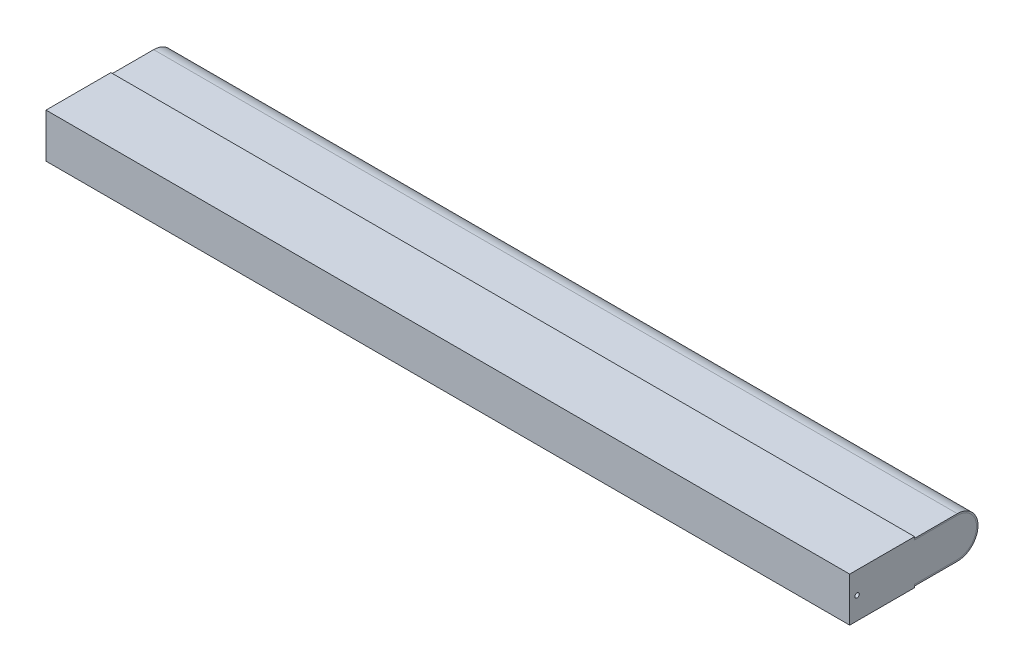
ISO-10303-21;
HEADER;
FILE_DESCRIPTION(('STEP AP214'),'2;1');
FILE_NAME('part.step','',(''),(''),'','','');
FILE_SCHEMA(('AUTOMOTIVE_DESIGN { 1 0 10303 214 1 1 1 1 }'));
ENDSEC;
DATA;
#1=APPLICATION_CONTEXT('core data for automotive mechanical design processes');
#2=APPLICATION_PROTOCOL_DEFINITION('international standard','automotive_design',2000,#1);
#3=PRODUCT_CONTEXT('',#1,'mechanical');
#4=PRODUCT('Part','Part','',(#3));
#5=PRODUCT_RELATED_PRODUCT_CATEGORY('part','',(#4));
#6=PRODUCT_DEFINITION_FORMATION('','',#4);
#7=PRODUCT_DEFINITION_CONTEXT('part definition',#1,'design');
#8=PRODUCT_DEFINITION('design','',#6,#7);
#9=PRODUCT_DEFINITION_SHAPE('','',#8);
#10=(LENGTH_UNIT() NAMED_UNIT(*) SI_UNIT(.MILLI.,.METRE.));
#11=(NAMED_UNIT(*) PLANE_ANGLE_UNIT() SI_UNIT($,.RADIAN.));
#12=(NAMED_UNIT(*) SI_UNIT($,.STERADIAN.) SOLID_ANGLE_UNIT());
#13=UNCERTAINTY_MEASURE_WITH_UNIT(LENGTH_MEASURE(1.E-05),#10,'distance_accuracy_value','');
#14=(GEOMETRIC_REPRESENTATION_CONTEXT(3) GLOBAL_UNCERTAINTY_ASSIGNED_CONTEXT((#13)) GLOBAL_UNIT_ASSIGNED_CONTEXT((#10,
#11,#12)) REPRESENTATION_CONTEXT('',''));
#15=CARTESIAN_POINT('',(0.,0.,0.));
#16=DIRECTION('',(0.,0.,1.));
#17=DIRECTION('',(1.,0.,0.));
#18=AXIS2_PLACEMENT_3D('',#15,#16,#17);
#19=CARTESIAN_POINT('',(545.,1.,-44.));
#20=DIRECTION('',(0.,-1.,0.));
#21=DIRECTION('',(0.,0.,-1.));
#22=AXIS2_PLACEMENT_3D('',#19,#20,#21);
#23=PLANE('',#22);
#24=DIRECTION('',(0.,0.,1.));
#25=VECTOR('',#24,1.);
#26=CARTESIAN_POINT('',(0.,1.,-44.));
#27=LINE('',#26,#25);
#28=CARTESIAN_POINT('',(0.,0.999999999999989,-73.));
#29=VERTEX_POINT('',#28);
#30=CARTESIAN_POINT('',(0.,1.,-44.));
#31=VERTEX_POINT('',#30);
#32=EDGE_CURVE('E146',#29,#31,#27,.T.);
#33=ORIENTED_EDGE('',*,*,#32,.F.);
#34=DIRECTION('',(-1.,0.,0.));
#35=VECTOR('',#34,1.);
#36=CARTESIAN_POINT('',(545.,0.999999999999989,-73.));
#37=LINE('',#36,#35);
#38=CARTESIAN_POINT('',(545.,0.999999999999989,-73.));
#39=VERTEX_POINT('',#38);
#40=EDGE_CURVE('E12',#39,#29,#37,.T.);
#41=ORIENTED_EDGE('',*,*,#40,.F.);
#42=DIRECTION('',(0.,0.,1.));
#43=VECTOR('',#42,1.);
#44=CARTESIAN_POINT('',(545.,1.,-44.));
#45=LINE('',#44,#43);
#46=CARTESIAN_POINT('',(545.,1.,-44.));
#47=VERTEX_POINT('',#46);
#48=EDGE_CURVE('E166',#39,#47,#45,.T.);
#49=ORIENTED_EDGE('',*,*,#48,.T.);
#50=DIRECTION('',(-1.,0.,0.));
#51=VECTOR('',#50,1.);
#52=CARTESIAN_POINT('',(545.,1.,-44.));
#53=LINE('',#52,#51);
#54=EDGE_CURVE('E52',#47,#31,#53,.T.);
#55=ORIENTED_EDGE('',*,*,#54,.T.);
#56=EDGE_LOOP('',(#33,#41,#49,#55));
#57=FACE_BOUND('',#56,.T.);
#58=ADVANCED_FACE('F49',(#57),#23,.T.);
#59=CARTESIAN_POINT('',(545.,15.,-73.));
#60=DIRECTION('',(-1.,0.,0.));
#61=DIRECTION('',(0.,0.,1.));
#62=AXIS2_PLACEMENT_3D('',#59,#60,#61);
#63=CYLINDRICAL_SURFACE('',#62,14.);
#64=CARTESIAN_POINT('',(0.,15.,-73.));
#65=DIRECTION('',(-1.,0.,0.));
#66=DIRECTION('',(0.,0.,1.));
#67=AXIS2_PLACEMENT_3D('',#64,#65,#66);
#68=CIRCLE('',#67,14.);
#69=CARTESIAN_POINT('',(0.,29.,-73.));
#70=VERTEX_POINT('',#69);
#71=EDGE_CURVE('E164',#70,#29,#68,.T.);
#72=ORIENTED_EDGE('',*,*,#71,.F.);
#73=DIRECTION('',(-1.,0.,0.));
#74=VECTOR('',#73,1.);
#75=CARTESIAN_POINT('',(545.,29.,-73.));
#76=LINE('',#75,#74);
#77=CARTESIAN_POINT('',(545.,29.,-73.));
#78=VERTEX_POINT('',#77);
#79=EDGE_CURVE('E58',#78,#70,#76,.T.);
#80=ORIENTED_EDGE('',*,*,#79,.F.);
#81=CARTESIAN_POINT('',(545.,15.,-73.));
#82=DIRECTION('',(-1.,0.,0.));
#83=DIRECTION('',(0.,0.,1.));
#84=AXIS2_PLACEMENT_3D('',#81,#82,#83);
#85=CIRCLE('',#84,14.);
#86=EDGE_CURVE('E136',#78,#39,#85,.T.);
#87=ORIENTED_EDGE('',*,*,#86,.T.);
#88=ORIENTED_EDGE('',*,*,#40,.T.);
#89=EDGE_LOOP('',(#72,#80,#87,#88));
#90=FACE_BOUND('',#89,.T.);
#91=ADVANCED_FACE('F178',(#90),#63,.T.);
#92=CARTESIAN_POINT('',(545.,29.,-73.));
#93=DIRECTION('',(0.,1.,0.));
#94=DIRECTION('',(0.,0.,1.));
#95=AXIS2_PLACEMENT_3D('',#92,#93,#94);
#96=PLANE('',#95);
#97=DIRECTION('',(0.,0.,-1.));
#98=VECTOR('',#97,1.);
#99=CARTESIAN_POINT('',(0.,29.,-73.));
#100=LINE('',#99,#98);
#101=CARTESIAN_POINT('',(0.,29.,-44.));
#102=VERTEX_POINT('',#101);
#103=EDGE_CURVE('E123',#102,#70,#100,.T.);
#104=ORIENTED_EDGE('',*,*,#103,.F.);
#105=DIRECTION('',(-1.,0.,0.));
#106=VECTOR('',#105,1.);
#107=CARTESIAN_POINT('',(545.,29.,-44.));
#108=LINE('',#107,#106);
#109=CARTESIAN_POINT('',(545.,29.,-44.));
#110=VERTEX_POINT('',#109);
#111=EDGE_CURVE('E118',#110,#102,#108,.T.);
#112=ORIENTED_EDGE('',*,*,#111,.F.);
#113=DIRECTION('',(0.,0.,-1.));
#114=VECTOR('',#113,1.);
#115=CARTESIAN_POINT('',(545.,29.,-73.));
#116=LINE('',#115,#114);
#117=EDGE_CURVE('E121',#110,#78,#116,.T.);
#118=ORIENTED_EDGE('',*,*,#117,.T.);
#119=ORIENTED_EDGE('',*,*,#79,.T.);
#120=EDGE_LOOP('',(#104,#112,#118,#119));
#121=FACE_BOUND('',#120,.T.);
#122=ADVANCED_FACE('F120',(#121),#96,.T.);
#123=CARTESIAN_POINT('',(545.,29.,-44.));
#124=DIRECTION('',(0.,0.,1.));
#125=DIRECTION('',(1.,0.,0.));
#126=AXIS2_PLACEMENT_3D('',#123,#124,#125);
#127=PLANE('',#126);
#128=DIRECTION('',(0.,1.,0.));
#129=VECTOR('',#128,1.);
#130=CARTESIAN_POINT('',(0.,29.,-44.));
#131=LINE('',#130,#129);
#132=CARTESIAN_POINT('',(0.,28.,-44.));
#133=VERTEX_POINT('',#132);
#134=EDGE_CURVE('E161',#133,#102,#131,.T.);
#135=ORIENTED_EDGE('',*,*,#134,.F.);
#136=DIRECTION('',(-1.,0.,0.));
#137=VECTOR('',#136,1.);
#138=CARTESIAN_POINT('',(545.,28.,-44.));
#139=LINE('',#138,#137);
#140=CARTESIAN_POINT('',(545.,28.,-44.));
#141=VERTEX_POINT('',#140);
#142=EDGE_CURVE('E128',#141,#133,#139,.T.);
#143=ORIENTED_EDGE('',*,*,#142,.F.);
#144=DIRECTION('',(0.,1.,0.));
#145=VECTOR('',#144,1.);
#146=CARTESIAN_POINT('',(545.,29.,-44.));
#147=LINE('',#146,#145);
#148=EDGE_CURVE('E134',#141,#110,#147,.T.);
#149=ORIENTED_EDGE('',*,*,#148,.T.);
#150=ORIENTED_EDGE('',*,*,#111,.T.);
#151=EDGE_LOOP('',(#135,#143,#149,#150));
#152=FACE_BOUND('',#151,.T.);
#153=ADVANCED_FACE('F138',(#152),#127,.T.);
#154=CARTESIAN_POINT('',(545.,28.,-73.));
#155=DIRECTION('',(0.,-1.,0.));
#156=DIRECTION('',(0.,0.,-1.));
#157=AXIS2_PLACEMENT_3D('',#154,#155,#156);
#158=PLANE('',#157);
#159=DIRECTION('',(0.,0.,1.));
#160=VECTOR('',#159,1.);
#161=CARTESIAN_POINT('',(0.,28.,-73.));
#162=LINE('',#161,#160);
#163=CARTESIAN_POINT('',(0.,28.,-73.));
#164=VERTEX_POINT('',#163);
#165=EDGE_CURVE('E158',#164,#133,#162,.T.);
#166=ORIENTED_EDGE('',*,*,#165,.F.);
#167=DIRECTION('',(-1.,0.,0.));
#168=VECTOR('',#167,1.);
#169=CARTESIAN_POINT('',(545.,28.,-73.));
#170=LINE('',#169,#168);
#171=CARTESIAN_POINT('',(545.,28.,-73.));
#172=VERTEX_POINT('',#171);
#173=EDGE_CURVE('E170',#172,#164,#170,.T.);
#174=ORIENTED_EDGE('',*,*,#173,.F.);
#175=DIRECTION('',(0.,0.,1.));
#176=VECTOR('',#175,1.);
#177=CARTESIAN_POINT('',(545.,28.,-73.));
#178=LINE('',#177,#176);
#179=EDGE_CURVE('E139',#172,#141,#178,.T.);
#180=ORIENTED_EDGE('',*,*,#179,.T.);
#181=ORIENTED_EDGE('',*,*,#142,.T.);
#182=EDGE_LOOP('',(#166,#174,#180,#181));
#183=FACE_BOUND('',#182,.T.);
#184=ADVANCED_FACE('F191',(#183),#158,.T.);
#185=CARTESIAN_POINT('',(545.,15.,-73.));
#186=DIRECTION('',(-1.,0.,0.));
#187=DIRECTION('',(0.,0.,1.));
#188=AXIS2_PLACEMENT_3D('',#185,#186,#187);
#189=CYLINDRICAL_SURFACE('',#188,13.);
#190=CARTESIAN_POINT('',(0.,15.,-73.));
#191=DIRECTION('',(1.,0.,0.));
#192=DIRECTION('',(0.,0.,1.));
#193=AXIS2_PLACEMENT_3D('',#190,#191,#192);
#194=CIRCLE('',#193,13.);
#195=CARTESIAN_POINT('',(0.,1.99999999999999,-73.));
#196=VERTEX_POINT('',#195);
#197=EDGE_CURVE('E155',#196,#164,#194,.T.);
#198=ORIENTED_EDGE('',*,*,#197,.F.);
#199=DIRECTION('',(-1.,0.,0.));
#200=VECTOR('',#199,1.);
#201=CARTESIAN_POINT('',(545.,1.99999999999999,-73.));
#202=LINE('',#201,#200);
#203=CARTESIAN_POINT('',(545.,1.99999999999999,-73.));
#204=VERTEX_POINT('',#203);
#205=EDGE_CURVE('E172',#204,#196,#202,.T.);
#206=ORIENTED_EDGE('',*,*,#205,.F.);
#207=CARTESIAN_POINT('',(545.,15.,-73.));
#208=DIRECTION('',(1.,0.,0.));
#209=DIRECTION('',(0.,0.,1.));
#210=AXIS2_PLACEMENT_3D('',#207,#208,#209);
#211=CIRCLE('',#210,13.);
#212=EDGE_CURVE('E141',#204,#172,#211,.T.);
#213=ORIENTED_EDGE('',*,*,#212,.T.);
#214=ORIENTED_EDGE('',*,*,#173,.T.);
#215=EDGE_LOOP('',(#198,#206,#213,#214));
#216=FACE_BOUND('',#215,.T.);
#217=ADVANCED_FACE('F194',(#216),#189,.F.);
#218=CARTESIAN_POINT('',(545.,2.,-44.));
#219=DIRECTION('',(0.,1.,0.));
#220=DIRECTION('',(0.,0.,1.));
#221=AXIS2_PLACEMENT_3D('',#218,#219,#220);
#222=PLANE('',#221);
#223=DIRECTION('',(0.,0.,-1.));
#224=VECTOR('',#223,1.);
#225=CARTESIAN_POINT('',(0.,2.,-44.));
#226=LINE('',#225,#224);
#227=CARTESIAN_POINT('',(0.,2.,-44.));
#228=VERTEX_POINT('',#227);
#229=EDGE_CURVE('E152',#228,#196,#226,.T.);
#230=ORIENTED_EDGE('',*,*,#229,.F.);
#231=DIRECTION('',(-1.,0.,0.));
#232=VECTOR('',#231,1.);
#233=CARTESIAN_POINT('',(545.,2.,-44.));
#234=LINE('',#233,#232);
#235=CARTESIAN_POINT('',(545.,2.,-44.));
#236=VERTEX_POINT('',#235);
#237=EDGE_CURVE('E173',#236,#228,#234,.T.);
#238=ORIENTED_EDGE('',*,*,#237,.F.);
#239=DIRECTION('',(0.,0.,-1.));
#240=VECTOR('',#239,1.);
#241=CARTESIAN_POINT('',(545.,2.,-44.));
#242=LINE('',#241,#240);
#243=EDGE_CURVE('E269',#236,#204,#242,.T.);
#244=ORIENTED_EDGE('',*,*,#243,.T.);
#245=ORIENTED_EDGE('',*,*,#205,.T.);
#246=EDGE_LOOP('',(#230,#238,#244,#245));
#247=FACE_BOUND('',#246,.T.);
#248=ADVANCED_FACE('F198',(#247),#222,.T.);
#249=CARTESIAN_POINT('',(545.,1.,-44.));
#250=DIRECTION('',(0.,0.,1.));
#251=DIRECTION('',(1.,0.,0.));
#252=AXIS2_PLACEMENT_3D('',#249,#250,#251);
#253=PLANE('',#252);
#254=DIRECTION('',(0.,1.,0.));
#255=VECTOR('',#254,1.);
#256=CARTESIAN_POINT('',(0.,1.,-44.));
#257=LINE('',#256,#255);
#258=EDGE_CURVE('E149',#31,#228,#257,.T.);
#259=ORIENTED_EDGE('',*,*,#258,.F.);
#260=ORIENTED_EDGE('',*,*,#54,.F.);
#261=DIRECTION('',(0.,1.,0.));
#262=VECTOR('',#261,1.);
#263=CARTESIAN_POINT('',(545.,1.,-44.));
#264=LINE('',#263,#262);
#265=EDGE_CURVE('E270',#47,#236,#264,.T.);
#266=ORIENTED_EDGE('',*,*,#265,.T.);
#267=ORIENTED_EDGE('',*,*,#237,.T.);
#268=EDGE_LOOP('',(#259,#260,#266,#267));
#269=FACE_BOUND('',#268,.T.);
#270=ADVANCED_FACE('F175',(#269),#253,.T.);
#271=CARTESIAN_POINT('',(545.,15.,-73.));
#272=DIRECTION('',(-1.,0.,0.));
#273=DIRECTION('',(0.,0.,1.));
#274=AXIS2_PLACEMENT_3D('',#271,#272,#273);
#275=PLANE('',#274);
#276=ORIENTED_EDGE('',*,*,#48,.F.);
#277=ORIENTED_EDGE('',*,*,#86,.F.);
#278=ORIENTED_EDGE('',*,*,#117,.F.);
#279=ORIENTED_EDGE('',*,*,#148,.F.);
#280=ORIENTED_EDGE('',*,*,#179,.F.);
#281=ORIENTED_EDGE('',*,*,#212,.F.);
#282=ORIENTED_EDGE('',*,*,#243,.F.);
#283=ORIENTED_EDGE('',*,*,#265,.F.);
#284=EDGE_LOOP('',(#276,#277,#278,#279,#280,#281,#282,#283));
#285=FACE_BOUND('',#284,.T.);
#286=ADVANCED_FACE('F132',(#285),#275,.F.);
#287=CARTESIAN_POINT('',(0.,15.,-73.));
#288=DIRECTION('',(-1.,0.,0.));
#289=DIRECTION('',(0.,0.,1.));
#290=AXIS2_PLACEMENT_3D('',#287,#288,#289);
#291=PLANE('',#290);
#292=ORIENTED_EDGE('',*,*,#32,.T.);
#293=ORIENTED_EDGE('',*,*,#258,.T.);
#294=ORIENTED_EDGE('',*,*,#229,.T.);
#295=ORIENTED_EDGE('',*,*,#197,.T.);
#296=ORIENTED_EDGE('',*,*,#165,.T.);
#297=ORIENTED_EDGE('',*,*,#134,.T.);
#298=ORIENTED_EDGE('',*,*,#103,.T.);
#299=ORIENTED_EDGE('',*,*,#71,.T.);
#300=EDGE_LOOP('',(#292,#293,#294,#295,#296,#297,#298,#299));
#301=FACE_BOUND('',#300,.T.);
#302=ADVANCED_FACE('F177',(#301),#291,.T.);
#303=CLOSED_SHELL('',(#58,#91,#122,#153,#184,#217,#248,#270,#286,#302));
#304=MANIFOLD_SOLID_BREP('B2',#303);
#305=CARTESIAN_POINT('',(545.,0.,-44.));
#306=DIRECTION('',(0.,1.,0.));
#307=DIRECTION('',(0.,0.,1.));
#308=AXIS2_PLACEMENT_3D('',#305,#306,#307);
#309=PLANE('',#308);
#310=DIRECTION('',(0.,0.,-1.));
#311=VECTOR('',#310,1.);
#312=CARTESIAN_POINT('',(0.,0.,-44.));
#313=LINE('',#312,#311);
#314=CARTESIAN_POINT('',(0.,0.,0.));
#315=VERTEX_POINT('',#314);
#316=CARTESIAN_POINT('',(0.,0.,-44.));
#317=VERTEX_POINT('',#316);
#318=EDGE_CURVE('E378',#315,#317,#313,.T.);
#319=ORIENTED_EDGE('',*,*,#318,.T.);
#320=DIRECTION('',(-1.,0.,0.));
#321=VECTOR('',#320,1.);
#322=CARTESIAN_POINT('',(545.,0.,-44.));
#323=LINE('',#322,#321);
#324=CARTESIAN_POINT('',(545.,0.,-44.));
#325=VERTEX_POINT('',#324);
#326=EDGE_CURVE('E47',#325,#317,#323,.T.);
#327=ORIENTED_EDGE('',*,*,#326,.F.);
#328=DIRECTION('',(0.,0.,-1.));
#329=VECTOR('',#328,1.);
#330=CARTESIAN_POINT('',(545.,0.,-44.));
#331=LINE('',#330,#329);
#332=CARTESIAN_POINT('',(545.,0.,0.));
#333=VERTEX_POINT('',#332);
#334=EDGE_CURVE('E401',#333,#325,#331,.T.);
#335=ORIENTED_EDGE('',*,*,#334,.F.);
#336=DIRECTION('',(-1.,0.,0.));
#337=VECTOR('',#336,1.);
#338=CARTESIAN_POINT('',(545.,0.,0.));
#339=LINE('',#338,#337);
#340=EDGE_CURVE('E374',#333,#315,#339,.T.);
#341=ORIENTED_EDGE('',*,*,#340,.T.);
#342=EDGE_LOOP('',(#319,#327,#335,#341));
#343=FACE_BOUND('',#342,.T.);
#344=ADVANCED_FACE('F277',(#343),#309,.F.);
#345=CARTESIAN_POINT('',(545.,2.,-44.));
#346=DIRECTION('',(0.,0.,1.));
#347=DIRECTION('',(1.,0.,0.));
#348=AXIS2_PLACEMENT_3D('',#345,#346,#347);
#349=PLANE('',#348);
#350=DIRECTION('',(0.,1.,0.));
#351=VECTOR('',#350,1.);
#352=CARTESIAN_POINT('',(0.,2.,-44.));
#353=LINE('',#352,#351);
#354=CARTESIAN_POINT('',(0.,2.,-44.));
#355=VERTEX_POINT('',#354);
#356=EDGE_CURVE('E382',#317,#355,#353,.T.);
#357=ORIENTED_EDGE('',*,*,#356,.T.);
#358=DIRECTION('',(-1.,0.,0.));
#359=VECTOR('',#358,1.);
#360=CARTESIAN_POINT('',(545.,2.,-44.));
#361=LINE('',#360,#359);
#362=CARTESIAN_POINT('',(545.,2.,-44.));
#363=VERTEX_POINT('',#362);
#364=EDGE_CURVE('E286',#363,#355,#361,.T.);
#365=ORIENTED_EDGE('',*,*,#364,.F.);
#366=DIRECTION('',(0.,1.,0.));
#367=VECTOR('',#366,1.);
#368=CARTESIAN_POINT('',(545.,2.,-44.));
#369=LINE('',#368,#367);
#370=EDGE_CURVE('E337',#325,#363,#369,.T.);
#371=ORIENTED_EDGE('',*,*,#370,.F.);
#372=ORIENTED_EDGE('',*,*,#326,.T.);
#373=EDGE_LOOP('',(#357,#365,#371,#372));
#374=FACE_BOUND('',#373,.T.);
#375=ADVANCED_FACE('F473',(#374),#349,.F.);
#376=CARTESIAN_POINT('',(545.,2.,-44.));
#377=DIRECTION('',(0.,1.,0.));
#378=DIRECTION('',(0.,0.,1.));
#379=AXIS2_PLACEMENT_3D('',#376,#377,#378);
#380=PLANE('',#379);
#381=DIRECTION('',(0.,0.,-1.));
#382=VECTOR('',#381,1.);
#383=CARTESIAN_POINT('',(0.,2.,-44.));
#384=LINE('',#383,#382);
#385=CARTESIAN_POINT('',(0.,1.99999999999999,-73.));
#386=VERTEX_POINT('',#385);
#387=EDGE_CURVE('E386',#355,#386,#384,.T.);
#388=ORIENTED_EDGE('',*,*,#387,.T.);
#389=DIRECTION('',(-1.,0.,0.));
#390=VECTOR('',#389,1.);
#391=CARTESIAN_POINT('',(545.,1.99999999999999,-73.));
#392=LINE('',#391,#390);
#393=CARTESIAN_POINT('',(545.,1.99999999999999,-73.));
#394=VERTEX_POINT('',#393);
#395=EDGE_CURVE('E412',#394,#386,#392,.T.);
#396=ORIENTED_EDGE('',*,*,#395,.F.);
#397=DIRECTION('',(0.,0.,-1.));
#398=VECTOR('',#397,1.);
#399=CARTESIAN_POINT('',(545.,2.,-44.));
#400=LINE('',#399,#398);
#401=EDGE_CURVE('E422',#363,#394,#400,.T.);
#402=ORIENTED_EDGE('',*,*,#401,.F.);
#403=ORIENTED_EDGE('',*,*,#364,.T.);
#404=EDGE_LOOP('',(#388,#396,#402,#403));
#405=FACE_BOUND('',#404,.T.);
#406=ADVANCED_FACE('F420',(#405),#380,.F.);
#407=CARTESIAN_POINT('',(545.,15.,-73.));
#408=DIRECTION('',(-1.,0.,0.));
#409=DIRECTION('',(0.,0.,1.));
#410=AXIS2_PLACEMENT_3D('',#407,#408,#409);
#411=CYLINDRICAL_SURFACE('',#410,13.);
#412=CARTESIAN_POINT('',(0.,15.,-73.));
#413=DIRECTION('',(1.,0.,0.));
#414=DIRECTION('',(0.,0.,-1.));
#415=AXIS2_PLACEMENT_3D('',#412,#413,#414);
#416=CIRCLE('',#415,13.);
#417=CARTESIAN_POINT('',(0.,28.,-73.));
#418=VERTEX_POINT('',#417);
#419=EDGE_CURVE('E389',#386,#418,#416,.T.);
#420=ORIENTED_EDGE('',*,*,#419,.T.);
#421=DIRECTION('',(-1.,0.,0.));
#422=VECTOR('',#421,1.);
#423=CARTESIAN_POINT('',(545.,28.,-73.));
#424=LINE('',#423,#422);
#425=CARTESIAN_POINT('',(545.,28.,-73.));
#426=VERTEX_POINT('',#425);
#427=EDGE_CURVE('E408',#426,#418,#424,.T.);
#428=ORIENTED_EDGE('',*,*,#427,.F.);
#429=CARTESIAN_POINT('',(545.,15.,-73.));
#430=DIRECTION('',(1.,0.,0.));
#431=DIRECTION('',(0.,0.,-1.));
#432=AXIS2_PLACEMENT_3D('',#429,#430,#431);
#433=CIRCLE('',#432,13.);
#434=EDGE_CURVE('E435',#394,#426,#433,.T.);
#435=ORIENTED_EDGE('',*,*,#434,.F.);
#436=ORIENTED_EDGE('',*,*,#395,.T.);
#437=EDGE_LOOP('',(#420,#428,#435,#436));
#438=FACE_BOUND('',#437,.T.);
#439=ADVANCED_FACE('F430',(#438),#411,.T.);
#440=CARTESIAN_POINT('',(545.,28.,-44.));
#441=DIRECTION('',(0.,-1.,0.));
#442=DIRECTION('',(0.,0.,-1.));
#443=AXIS2_PLACEMENT_3D('',#440,#441,#442);
#444=PLANE('',#443);
#445=DIRECTION('',(0.,0.,1.));
#446=VECTOR('',#445,1.);
#447=CARTESIAN_POINT('',(0.,28.,-44.));
#448=LINE('',#447,#446);
#449=CARTESIAN_POINT('',(0.,28.,-44.));
#450=VERTEX_POINT('',#449);
#451=EDGE_CURVE('E392',#418,#450,#448,.T.);
#452=ORIENTED_EDGE('',*,*,#451,.T.);
#453=DIRECTION('',(-1.,0.,0.));
#454=VECTOR('',#453,1.);
#455=CARTESIAN_POINT('',(545.,28.,-44.));
#456=LINE('',#455,#454);
#457=CARTESIAN_POINT('',(545.,28.,-44.));
#458=VERTEX_POINT('',#457);
#459=EDGE_CURVE('E367',#458,#450,#456,.T.);
#460=ORIENTED_EDGE('',*,*,#459,.F.);
#461=DIRECTION('',(0.,0.,1.));
#462=VECTOR('',#461,1.);
#463=CARTESIAN_POINT('',(545.,28.,-44.));
#464=LINE('',#463,#462);
#465=EDGE_CURVE('E356',#426,#458,#464,.T.);
#466=ORIENTED_EDGE('',*,*,#465,.F.);
#467=ORIENTED_EDGE('',*,*,#427,.T.);
#468=EDGE_LOOP('',(#452,#460,#466,#467));
#469=FACE_BOUND('',#468,.T.);
#470=ADVANCED_FACE('F433',(#469),#444,.F.);
#471=CARTESIAN_POINT('',(545.,30.,-44.));
#472=DIRECTION('',(0.,0.,1.));
#473=DIRECTION('',(1.,0.,0.));
#474=AXIS2_PLACEMENT_3D('',#471,#472,#473);
#475=PLANE('',#474);
#476=DIRECTION('',(0.,1.,0.));
#477=VECTOR('',#476,1.);
#478=CARTESIAN_POINT('',(0.,30.,-44.));
#479=LINE('',#478,#477);
#480=CARTESIAN_POINT('',(0.,30.,-44.));
#481=VERTEX_POINT('',#480);
#482=EDGE_CURVE('E365',#450,#481,#479,.T.);
#483=ORIENTED_EDGE('',*,*,#482,.T.);
#484=DIRECTION('',(-1.,0.,0.));
#485=VECTOR('',#484,1.);
#486=CARTESIAN_POINT('',(545.,30.,-44.));
#487=LINE('',#486,#485);
#488=CARTESIAN_POINT('',(545.,30.,-44.));
#489=VERTEX_POINT('',#488);
#490=EDGE_CURVE('E362',#489,#481,#487,.T.);
#491=ORIENTED_EDGE('',*,*,#490,.F.);
#492=DIRECTION('',(0.,1.,0.));
#493=VECTOR('',#492,1.);
#494=CARTESIAN_POINT('',(545.,30.,-44.));
#495=LINE('',#494,#493);
#496=EDGE_CURVE('E350',#458,#489,#495,.T.);
#497=ORIENTED_EDGE('',*,*,#496,.F.);
#498=ORIENTED_EDGE('',*,*,#459,.T.);
#499=EDGE_LOOP('',(#483,#491,#497,#498));
#500=FACE_BOUND('',#499,.T.);
#501=ADVANCED_FACE('F363',(#500),#475,.F.);
#502=CARTESIAN_POINT('',(545.,30.,0.));
#503=DIRECTION('',(0.,-1.,0.));
#504=DIRECTION('',(0.,0.,-1.));
#505=AXIS2_PLACEMENT_3D('',#502,#503,#504);
#506=PLANE('',#505);
#507=DIRECTION('',(0.,0.,1.));
#508=VECTOR('',#507,1.);
#509=CARTESIAN_POINT('',(0.,30.,0.));
#510=LINE('',#509,#508);
#511=CARTESIAN_POINT('',(0.,30.,0.));
#512=VERTEX_POINT('',#511);
#513=EDGE_CURVE('E323',#481,#512,#510,.T.);
#514=ORIENTED_EDGE('',*,*,#513,.T.);
#515=DIRECTION('',(-1.,0.,0.));
#516=VECTOR('',#515,1.);
#517=CARTESIAN_POINT('',(545.,30.,0.));
#518=LINE('',#517,#516);
#519=CARTESIAN_POINT('',(545.,30.,0.));
#520=VERTEX_POINT('',#519);
#521=EDGE_CURVE('E368',#520,#512,#518,.T.);
#522=ORIENTED_EDGE('',*,*,#521,.F.);
#523=DIRECTION('',(0.,0.,1.));
#524=VECTOR('',#523,1.);
#525=CARTESIAN_POINT('',(545.,30.,0.));
#526=LINE('',#525,#524);
#527=EDGE_CURVE('E354',#489,#520,#526,.T.);
#528=ORIENTED_EDGE('',*,*,#527,.F.);
#529=ORIENTED_EDGE('',*,*,#490,.T.);
#530=EDGE_LOOP('',(#514,#522,#528,#529));
#531=FACE_BOUND('',#530,.T.);
#532=ADVANCED_FACE('F370',(#531),#506,.F.);
#533=CARTESIAN_POINT('',(545.,0.,0.));
#534=DIRECTION('',(0.,0.,-1.));
#535=DIRECTION('',(-1.,0.,0.));
#536=AXIS2_PLACEMENT_3D('',#533,#534,#535);
#537=PLANE('',#536);
#538=DIRECTION('',(0.,-1.,0.));
#539=VECTOR('',#538,1.);
#540=CARTESIAN_POINT('',(0.,0.,0.));
#541=LINE('',#540,#539);
#542=EDGE_CURVE('E329',#512,#315,#541,.T.);
#543=ORIENTED_EDGE('',*,*,#542,.T.);
#544=ORIENTED_EDGE('',*,*,#340,.F.);
#545=DIRECTION('',(0.,-1.,0.));
#546=VECTOR('',#545,1.);
#547=CARTESIAN_POINT('',(545.,0.,0.));
#548=LINE('',#547,#546);
#549=EDGE_CURVE('E294',#520,#333,#548,.T.);
#550=ORIENTED_EDGE('',*,*,#549,.F.);
#551=ORIENTED_EDGE('',*,*,#521,.T.);
#552=EDGE_LOOP('',(#543,#544,#550,#551));
#553=FACE_BOUND('',#552,.T.);
#554=ADVANCED_FACE('F480',(#553),#537,.F.);
#555=CARTESIAN_POINT('',(545.,15.,-73.));
#556=DIRECTION('',(1.,0.,0.));
#557=DIRECTION('',(0.,0.,-1.));
#558=AXIS2_PLACEMENT_3D('',#555,#556,#557);
#559=PLANE('',#558);
#560=CARTESIAN_POINT('',(545.,15.,-5.));
#561=DIRECTION('',(-1.,0.,0.));
#562=DIRECTION('',(0.,0.,1.));
#563=AXIS2_PLACEMENT_3D('',#560,#561,#562);
#564=CIRCLE('',#563,1.5);
#565=CARTESIAN_POINT('',(545.,15.,-3.5));
#566=VERTEX_POINT('',#565);
#567=EDGE_CURVE('E453',#566,#566,#564,.T.);
#568=ORIENTED_EDGE('',*,*,#567,.T.);
#569=EDGE_LOOP('',(#568));
#570=FACE_BOUND('',#569,.T.);
#571=ORIENTED_EDGE('',*,*,#334,.T.);
#572=ORIENTED_EDGE('',*,*,#370,.T.);
#573=ORIENTED_EDGE('',*,*,#401,.T.);
#574=ORIENTED_EDGE('',*,*,#434,.T.);
#575=ORIENTED_EDGE('',*,*,#465,.T.);
#576=ORIENTED_EDGE('',*,*,#496,.T.);
#577=ORIENTED_EDGE('',*,*,#527,.T.);
#578=ORIENTED_EDGE('',*,*,#549,.T.);
#579=EDGE_LOOP('',(#571,#572,#573,#574,#575,#576,#577,#578));
#580=FACE_BOUND('',#579,.T.);
#581=ADVANCED_FACE('F352',(#570,#580),#559,.T.);
#582=CARTESIAN_POINT('',(0.,15.,-73.));
#583=DIRECTION('',(1.,0.,0.));
#584=DIRECTION('',(0.,0.,-1.));
#585=AXIS2_PLACEMENT_3D('',#582,#583,#584);
#586=PLANE('',#585);
#587=CARTESIAN_POINT('',(0.,15.,-5.));
#588=DIRECTION('',(-1.,0.,0.));
#589=DIRECTION('',(0.,0.,1.));
#590=AXIS2_PLACEMENT_3D('',#587,#588,#589);
#591=CIRCLE('',#590,1.5);
#592=CARTESIAN_POINT('',(0.,15.,-3.5));
#593=VERTEX_POINT('',#592);
#594=EDGE_CURVE('E445',#593,#593,#591,.T.);
#595=ORIENTED_EDGE('',*,*,#594,.F.);
#596=EDGE_LOOP('',(#595));
#597=FACE_BOUND('',#596,.T.);
#598=ORIENTED_EDGE('',*,*,#318,.F.);
#599=ORIENTED_EDGE('',*,*,#542,.F.);
#600=ORIENTED_EDGE('',*,*,#513,.F.);
#601=ORIENTED_EDGE('',*,*,#482,.F.);
#602=ORIENTED_EDGE('',*,*,#451,.F.);
#603=ORIENTED_EDGE('',*,*,#419,.F.);
#604=ORIENTED_EDGE('',*,*,#387,.F.);
#605=ORIENTED_EDGE('',*,*,#356,.F.);
#606=EDGE_LOOP('',(#598,#599,#600,#601,#602,#603,#604,#605));
#607=FACE_BOUND('',#606,.T.);
#608=ADVANCED_FACE('F426',(#597,#607),#586,.F.);
#609=CARTESIAN_POINT('',(15.,15.,-5.));
#610=DIRECTION('',(-1.,0.,0.));
#611=DIRECTION('',(0.,0.,1.));
#612=AXIS2_PLACEMENT_3D('',#609,#610,#611);
#613=CYLINDRICAL_SURFACE('',#612,1.5);
#614=CARTESIAN_POINT('',(15.,15.,-5.));
#615=DIRECTION('',(-1.,0.,0.));
#616=DIRECTION('',(0.,0.,1.));
#617=AXIS2_PLACEMENT_3D('',#614,#615,#616);
#618=CIRCLE('',#617,1.5);
#619=CARTESIAN_POINT('',(15.,15.,-3.5));
#620=VERTEX_POINT('',#619);
#621=EDGE_CURVE('E383',#620,#620,#618,.T.);
#622=ORIENTED_EDGE('',*,*,#621,.F.);
#623=EDGE_LOOP('',(#622));
#624=FACE_BOUND('',#623,.T.);
#625=ORIENTED_EDGE('',*,*,#594,.T.);
#626=EDGE_LOOP('',(#625));
#627=FACE_BOUND('',#626,.T.);
#628=ADVANCED_FACE('F533',(#624,#627),#613,.F.);
#629=CARTESIAN_POINT('',(15.,15.,-5.));
#630=DIRECTION('',(-1.,0.,0.));
#631=DIRECTION('',(0.,0.,1.));
#632=AXIS2_PLACEMENT_3D('',#629,#630,#631);
#633=PLANE('',#632);
#634=ORIENTED_EDGE('',*,*,#621,.T.);
#635=EDGE_LOOP('',(#634));
#636=FACE_BOUND('',#635,.T.);
#637=ADVANCED_FACE('F470',(#636),#633,.T.);
#638=CARTESIAN_POINT('',(530.,15.,-5.));
#639=DIRECTION('',(1.,0.,0.));
#640=DIRECTION('',(0.,0.,-1.));
#641=AXIS2_PLACEMENT_3D('',#638,#639,#640);
#642=CYLINDRICAL_SURFACE('',#641,1.5);
#643=CARTESIAN_POINT('',(530.,15.,-5.));
#644=DIRECTION('',(-1.,0.,0.));
#645=DIRECTION('',(0.,0.,1.));
#646=AXIS2_PLACEMENT_3D('',#643,#644,#645);
#647=CIRCLE('',#646,1.5);
#648=CARTESIAN_POINT('',(530.,15.,-3.5));
#649=VERTEX_POINT('',#648);
#650=EDGE_CURVE('E449',#649,#649,#647,.T.);
#651=ORIENTED_EDGE('',*,*,#650,.T.);
#652=EDGE_LOOP('',(#651));
#653=FACE_BOUND('',#652,.T.);
#654=ORIENTED_EDGE('',*,*,#567,.F.);
#655=EDGE_LOOP('',(#654));
#656=FACE_BOUND('',#655,.T.);
#657=ADVANCED_FACE('F461',(#653,#656),#642,.F.);
#658=CARTESIAN_POINT('',(530.,15.,-5.));
#659=DIRECTION('',(1.,0.,0.));
#660=DIRECTION('',(0.,0.,1.));
#661=AXIS2_PLACEMENT_3D('',#658,#659,#660);
#662=PLANE('',#661);
#663=ORIENTED_EDGE('',*,*,#650,.F.);
#664=EDGE_LOOP('',(#663));
#665=FACE_BOUND('',#664,.T.);
#666=ADVANCED_FACE('F464',(#665),#662,.T.);
#667=CLOSED_SHELL('',(#344,#375,#406,#439,#470,#501,#532,#554,#581,#608,#628,#637,#657,#666));
#668=MANIFOLD_SOLID_BREP('B6',#667);
#669=ADVANCED_BREP_SHAPE_REPRESENTATION('',(#18,#304,#668),#14);
#670=SHAPE_DEFINITION_REPRESENTATION(#9,#669);
ENDSEC;
END-ISO-10303-21;
